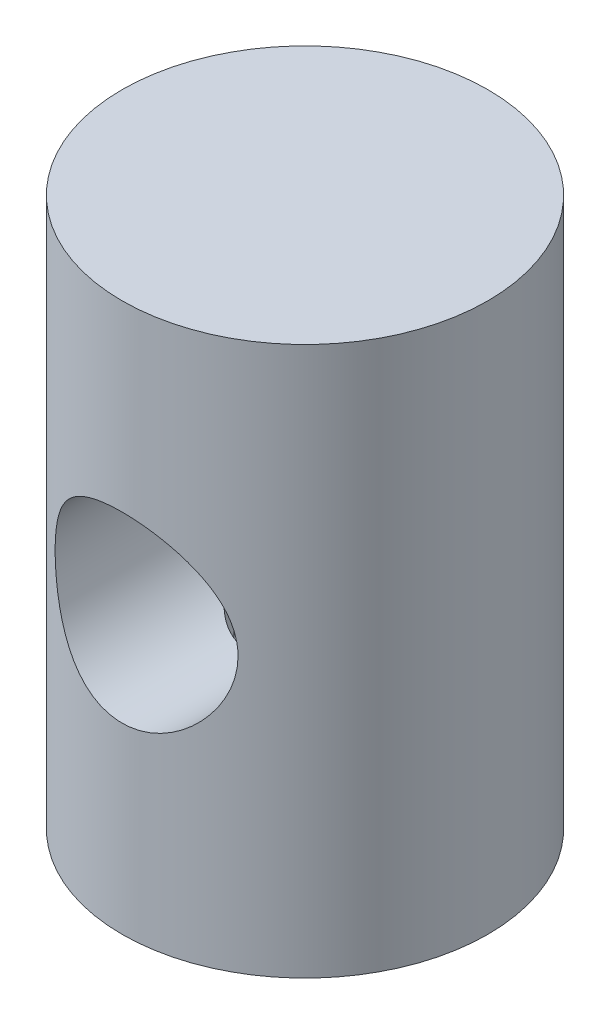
ISO-10303-21;
HEADER;
FILE_DESCRIPTION(('STEP AP214'),'2;1');
FILE_NAME('part.step','',(''),(''),'','','');
FILE_SCHEMA(('AUTOMOTIVE_DESIGN { 1 0 10303 214 1 1 1 1 }'));
ENDSEC;
DATA;
#1=APPLICATION_CONTEXT('core data for automotive mechanical design processes');
#2=APPLICATION_PROTOCOL_DEFINITION('international standard','automotive_design',2000,#1);
#3=PRODUCT_CONTEXT('',#1,'mechanical');
#4=PRODUCT('Part','Part','',(#3));
#5=PRODUCT_RELATED_PRODUCT_CATEGORY('part','',(#4));
#6=PRODUCT_DEFINITION_FORMATION('','',#4);
#7=PRODUCT_DEFINITION_CONTEXT('part definition',#1,'design');
#8=PRODUCT_DEFINITION('design','',#6,#7);
#9=PRODUCT_DEFINITION_SHAPE('','',#8);
#10=(LENGTH_UNIT() NAMED_UNIT(*) SI_UNIT(.MILLI.,.METRE.));
#11=(NAMED_UNIT(*) PLANE_ANGLE_UNIT() SI_UNIT($,.RADIAN.));
#12=(NAMED_UNIT(*) SI_UNIT($,.STERADIAN.) SOLID_ANGLE_UNIT());
#13=UNCERTAINTY_MEASURE_WITH_UNIT(LENGTH_MEASURE(1.E-05),#10,'distance_accuracy_value','');
#14=(GEOMETRIC_REPRESENTATION_CONTEXT(3) GLOBAL_UNCERTAINTY_ASSIGNED_CONTEXT((#13)) GLOBAL_UNIT_ASSIGNED_CONTEXT((#10,
#11,#12)) REPRESENTATION_CONTEXT('',''));
#15=CARTESIAN_POINT('',(0.,0.,0.));
#16=DIRECTION('',(0.,0.,1.));
#17=DIRECTION('',(1.,0.,0.));
#18=AXIS2_PLACEMENT_3D('',#15,#16,#17);
#19=CARTESIAN_POINT('',(0.,-6.,0.));
#20=DIRECTION('',(0.,1.,0.));
#21=DIRECTION('',(1.,0.,0.));
#22=AXIS2_PLACEMENT_3D('',#19,#20,#21);
#23=PLANE('',#22);
#24=CARTESIAN_POINT('',(0.,-6.,0.));
#25=DIRECTION('',(0.,1.,0.));
#26=DIRECTION('',(1.,0.,0.));
#27=AXIS2_PLACEMENT_3D('',#24,#25,#26);
#28=CIRCLE('',#27,4.);
#29=CARTESIAN_POINT('',(4.,-6.,0.));
#30=VERTEX_POINT('',#29);
#31=EDGE_CURVE('E106',#30,#30,#28,.T.);
#32=ORIENTED_EDGE('',*,*,#31,.F.);
#33=EDGE_LOOP('',(#32));
#34=FACE_BOUND('',#33,.T.);
#35=CARTESIAN_POINT('',(0.,-6.,0.));
#36=DIRECTION('',(0.,1.,0.));
#37=DIRECTION('',(1.,0.,0.));
#38=AXIS2_PLACEMENT_3D('',#35,#36,#37);
#39=CIRCLE('',#38,1.5);
#40=CARTESIAN_POINT('',(1.5,-6.,0.));
#41=VERTEX_POINT('',#40);
#42=EDGE_CURVE('E9',#41,#41,#39,.F.);
#43=ORIENTED_EDGE('',*,*,#42,.F.);
#44=EDGE_LOOP('',(#43));
#45=FACE_BOUND('',#44,.T.);
#46=ADVANCED_FACE('F14',(#34,#45),#23,.F.);
#47=CARTESIAN_POINT('',(0.,6.,0.));
#48=DIRECTION('',(0.,-1.,0.));
#49=DIRECTION('',(-1.,0.,0.));
#50=AXIS2_PLACEMENT_3D('',#47,#48,#49);
#51=CYLINDRICAL_SURFACE('',#50,4.);
#52=CARTESIAN_POINT('',(0.,-2.,-4.));
#53=CARTESIAN_POINT('',(0.105143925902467,-1.99999339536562,-3.99999426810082));
#54=CARTESIAN_POINT('',(0.210413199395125,-1.99165985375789,-3.99580982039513));
#55=CARTESIAN_POINT('',(0.417840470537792,-1.95869423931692,-3.97948312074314));
#56=CARTESIAN_POINT('',(0.51999217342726,-1.93403121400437,-3.96732575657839));
#57=CARTESIAN_POINT('',(0.717867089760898,-1.86961238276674,-3.93632558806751));
#58=CARTESIAN_POINT('',(0.813613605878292,-1.82991523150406,-3.91750878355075));
#59=CARTESIAN_POINT('',(0.996945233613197,-1.73685875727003,-3.87491553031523));
#60=CARTESIAN_POINT('',(1.08453098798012,-1.68350051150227,-3.85113947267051));
#61=CARTESIAN_POINT('',(1.25501563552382,-1.56096550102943,-3.79912516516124));
#62=CARTESIAN_POINT('',(1.33731042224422,-1.49102704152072,-3.77070398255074));
#63=CARTESIAN_POINT('',(1.48955888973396,-1.33895704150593,-3.71319940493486));
#64=CARTESIAN_POINT('',(1.55950316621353,-1.25681629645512,-3.68411552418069));
#65=CARTESIAN_POINT('',(1.69050400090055,-1.07503330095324,-3.62597902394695));
#66=CARTESIAN_POINT('',(1.75045067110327,-0.974527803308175,-3.59710373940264));
#67=CARTESIAN_POINT('',(1.85233645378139,-0.763265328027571,-3.54571957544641));
#68=CARTESIAN_POINT('',(1.89428842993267,-0.652515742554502,-3.52320615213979));
#69=CARTESIAN_POINT('',(1.95626488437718,-0.430669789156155,-3.48915734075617));
#70=CARTESIAN_POINT('',(1.97745171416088,-0.319991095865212,-3.47704543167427));
#71=CARTESIAN_POINT('',(2.00085398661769,-0.0960423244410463,-3.46363779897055));
#72=CARTESIAN_POINT('',(2.00308817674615,0.0172250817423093,-3.46233138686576));
#73=CARTESIAN_POINT('',(1.98937457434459,0.228572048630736,-3.47021860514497));
#74=CARTESIAN_POINT('',(1.97556911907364,0.3268480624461,-3.47817527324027));
#75=CARTESIAN_POINT('',(1.93387969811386,0.519443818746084,-3.50152457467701));
#76=CARTESIAN_POINT('',(1.9059912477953,0.613762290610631,-3.51691957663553));
#77=CARTESIAN_POINT('',(1.83641956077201,0.798458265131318,-3.55374952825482));
#78=CARTESIAN_POINT('',(1.79443013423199,0.888692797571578,-3.57531681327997));
#79=CARTESIAN_POINT('',(1.698083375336,1.06126858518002,-3.62206808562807));
#80=CARTESIAN_POINT('',(1.64372048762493,1.14360627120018,-3.64725369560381));
#81=CARTESIAN_POINT('',(1.51613210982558,1.30904250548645,-3.70226315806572));
#82=CARTESIAN_POINT('',(1.44138891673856,1.39091374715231,-3.73227020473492));
#83=CARTESIAN_POINT('',(1.27911115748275,1.5414708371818,-3.79095246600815));
#84=CARTESIAN_POINT('',(1.19157051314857,1.61015038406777,-3.81962703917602));
#85=CARTESIAN_POINT('',(1.0010330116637,1.73537132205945,-3.87403974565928));
#86=CARTESIAN_POINT('',(0.897507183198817,1.79120094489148,-3.89957968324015));
#87=CARTESIAN_POINT('',(0.680932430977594,1.88419405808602,-3.94315762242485));
#88=CARTESIAN_POINT('',(0.567891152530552,1.92137237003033,-3.96120157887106));
#89=CARTESIAN_POINT('',(0.345532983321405,1.97295080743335,-3.98648667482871));
#90=CARTESIAN_POINT('',(0.236683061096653,1.98898247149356,-3.9944987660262));
#91=CARTESIAN_POINT('',(0.0175591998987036,2.00292946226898,-4.00146026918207));
#92=CARTESIAN_POINT('',(-0.0927140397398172,2.00085337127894,-4.00041397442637));
#93=CARTESIAN_POINT('',(-0.302465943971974,1.97958662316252,-3.9898238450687));
#94=CARTESIAN_POINT('',(-0.40211881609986,1.96173493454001,-3.98094491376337));
#95=CARTESIAN_POINT('',(-0.596813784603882,1.91152385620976,-3.95644342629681));
#96=CARTESIAN_POINT('',(-0.691855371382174,1.87916286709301,-3.94082012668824));
#97=CARTESIAN_POINT('',(-0.877777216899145,1.80000306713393,-3.90368502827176));
#98=CARTESIAN_POINT('',(-0.968460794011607,1.75281789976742,-3.88201763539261));
#99=CARTESIAN_POINT('',(-1.14092272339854,1.64578492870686,-3.83487948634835));
#100=CARTESIAN_POINT('',(-1.22269725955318,1.58593173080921,-3.80940711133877));
#101=CARTESIAN_POINT('',(-1.38353537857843,1.44847914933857,-3.75416442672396));
#102=CARTESIAN_POINT('',(-1.46154415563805,1.36971426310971,-3.72421769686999));
#103=CARTESIAN_POINT('',(-1.60371264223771,1.20014969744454,-3.6652478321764));
#104=CARTESIAN_POINT('',(-1.66786277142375,1.10934176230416,-3.63622534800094));
#105=CARTESIAN_POINT('',(-1.78341582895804,0.912712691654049,-3.58102384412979));
#106=CARTESIAN_POINT('',(-1.8340509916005,0.806377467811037,-3.55505059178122));
#107=CARTESIAN_POINT('',(-1.91616565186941,0.584979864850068,-3.51148144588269));
#108=CARTESIAN_POINT('',(-1.94766983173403,0.46992894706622,-3.493874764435));
#109=CARTESIAN_POINT('',(-1.98772337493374,0.246179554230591,-3.47123002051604));
#110=CARTESIAN_POINT('',(-1.9981859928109,0.137931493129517,-3.4651476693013));
#111=CARTESIAN_POINT('',(-2.00137830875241,-0.0788941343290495,-3.46330709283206));
#112=CARTESIAN_POINT('',(-1.99411569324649,-0.187471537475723,-3.4675443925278));
#113=CARTESIAN_POINT('',(-1.96385225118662,-0.390967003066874,-3.48475724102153));
#114=CARTESIAN_POINT('',(-1.94241662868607,-0.486200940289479,-3.49686188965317));
#115=CARTESIAN_POINT('',(-1.88635071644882,-0.671616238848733,-3.52742032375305));
#116=CARTESIAN_POINT('',(-1.85171618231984,-0.761795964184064,-3.54587615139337));
#117=CARTESIAN_POINT('',(-1.76763149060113,-0.941249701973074,-3.58857060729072));
#118=CARTESIAN_POINT('',(-1.7173422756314,-1.03005580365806,-3.61311444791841));
#119=CARTESIAN_POINT('',(-1.60430194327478,-1.19854907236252,-3.66470663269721));
#120=CARTESIAN_POINT('',(-1.54154434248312,-1.27823146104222,-3.69175627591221));
#121=CARTESIAN_POINT('',(-1.39640665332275,-1.43628396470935,-3.74924646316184));
#122=CARTESIAN_POINT('',(-1.31256884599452,-1.51331820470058,-3.77969966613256));
#123=CARTESIAN_POINT('',(-1.13230961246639,-1.65252596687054,-3.83755504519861));
#124=CARTESIAN_POINT('',(-1.03588144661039,-1.71469147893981,-3.8649555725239));
#125=CARTESIAN_POINT('',(-0.831863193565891,-1.82247272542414,-3.91396019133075));
#126=CARTESIAN_POINT('',(-0.724199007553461,-1.86796833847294,-3.93552192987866));
#127=CARTESIAN_POINT('',(-0.501484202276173,-1.93961633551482,-3.97002682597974));
#128=CARTESIAN_POINT('',(-0.3864555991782,-1.96582369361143,-3.98299446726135));
#129=CARTESIAN_POINT('',(-0.22520389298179,-1.98779482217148,-3.99390923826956));
#130=CARTESIAN_POINT('',(-0.18032375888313,-1.99236528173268,-3.99618730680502));
#131=CARTESIAN_POINT('',(-0.0903034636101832,-1.99846933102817,-3.99923393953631));
#132=CARTESIAN_POINT('',(-0.0451632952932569,-2.00000283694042,-4.00000246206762));
#133=CARTESIAN_POINT('',(0.,-2.,-4.));
#134=B_SPLINE_CURVE_WITH_KNOTS('',3,(#52,#53,#54,#55,#56,#57,#58,#59,#60,#61,#62,#63,#64,#65,
#66,#67,#68,#69,#70,#71,#72,#73,#74,#75,#76,#77,#78,#79,#80,#81,#82,#83,#84,#85,#86,#87,#88,#89,
#90,#91,#92,#93,#94,#95,#96,#97,#98,#99,#100,#101,#102,#103,#104,#105,#106,#107,#108,#109,#110,
#111,#112,#113,#114,#115,#116,#117,#118,#119,#120,#121,#122,#123,#124,#125,#126,#127,#128,#129,
#130,#131,#132,#133),.UNSPECIFIED.,.T.,.F.,(4,2,2,2,2,2,2,2,2,2,2,2,2,2,2,2,2,2,2,2,2,2,2,2,2,2,
2,2,2,2,2,2,2,2,2,2,2,2,2,2,4),(0.,0.315248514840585,0.631096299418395,0.945724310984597,
1.26032752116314,1.59396351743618,1.92785247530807,2.28763452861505,2.64715895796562,
2.98516024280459,3.32282714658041,3.62011424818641,3.91749607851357,4.22180480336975,
4.52625042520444,4.86929882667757,5.21251069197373,5.57166044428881,5.93052433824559,
6.25966580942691,6.58865129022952,6.89213813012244,7.19565843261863,7.50785712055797,
7.82018901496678,8.16319221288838,8.50643177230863,8.86629364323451,9.22569023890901,
9.55058615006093,9.87534119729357,10.1691586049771,10.463070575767,10.7767291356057,
11.0905512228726,11.4425048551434,11.7946476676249,12.1492802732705,12.502898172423,
12.6383056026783,12.7737167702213),.UNSPECIFIED.);
#135=CARTESIAN_POINT('',(0.,-2.,-4.));
#136=VERTEX_POINT('',#135);
#137=EDGE_CURVE('E213',#136,#136,#134,.T.);
#138=ORIENTED_EDGE('',*,*,#137,.T.);
#139=EDGE_LOOP('',(#138));
#140=FACE_BOUND('',#139,.T.);
#141=CARTESIAN_POINT('',(2.,0.,3.46410161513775));
#142=CARTESIAN_POINT('',(1.99999158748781,-0.104213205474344,3.46411185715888));
#143=CARTESIAN_POINT('',(1.99179963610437,-0.208562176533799,3.46887633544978));
#144=CARTESIAN_POINT('',(1.95944672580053,-0.414055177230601,3.48724701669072));
#145=CARTESIAN_POINT('',(1.93525221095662,-0.515192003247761,3.50087179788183));
#146=CARTESIAN_POINT('',(1.8721998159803,-0.710903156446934,3.53498701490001));
#147=CARTESIAN_POINT('',(1.83341988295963,-0.80550925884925,3.55544089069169));
#148=CARTESIAN_POINT('',(1.74253507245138,-0.986848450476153,3.60085327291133));
#149=CARTESIAN_POINT('',(1.69042947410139,-1.07358111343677,3.62581202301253));
#150=CARTESIAN_POINT('',(1.569333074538,-1.24461144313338,3.67993738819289));
#151=CARTESIAN_POINT('',(1.49930407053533,-1.32811826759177,3.70928127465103));
#152=CARTESIAN_POINT('',(1.34650761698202,-1.4828167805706,3.76743965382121));
#153=CARTESIAN_POINT('',(1.26373385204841,-1.55400232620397,3.79625387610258));
#154=CARTESIAN_POINT('',(1.08097912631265,-1.6867343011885,3.85242953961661));
#155=CARTESIAN_POINT('',(0.980214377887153,-1.74730753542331,3.87956212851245));
#156=CARTESIAN_POINT('',(0.768314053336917,-1.85028170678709,3.92701512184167));
#157=CARTESIAN_POINT('',(0.657185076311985,-1.8926941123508,3.94733982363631));
#158=CARTESIAN_POINT('',(0.436089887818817,-1.95500932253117,3.97760922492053));
#159=CARTESIAN_POINT('',(0.326603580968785,-1.9762990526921,3.9881896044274));
#160=CARTESIAN_POINT('',(0.10514125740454,-2.00033223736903,4.00015167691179));
#161=CARTESIAN_POINT('',(-0.0068332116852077,-2.00308691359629,4.00153893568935));
#162=CARTESIAN_POINT('',(-0.219665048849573,-1.99050665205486,3.99525963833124));
#163=CARTESIAN_POINT('',(-0.320642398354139,-1.97672396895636,3.98836991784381));
#164=CARTESIAN_POINT('',(-0.518627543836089,-1.93423831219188,3.96748490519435));
#165=CARTESIAN_POINT('',(-0.615635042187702,-1.90553422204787,3.95348908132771));
#166=CARTESIAN_POINT('',(-0.80461878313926,-1.83383486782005,3.91943166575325));
#167=CARTESIAN_POINT('',(-0.896506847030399,-1.79064737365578,3.89928883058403));
#168=CARTESIAN_POINT('',(-1.07195360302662,-1.6914731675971,3.8547529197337));
#169=CARTESIAN_POINT('',(-1.15550929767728,-1.63548187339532,3.83035832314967));
#170=CARTESIAN_POINT('',(-1.3203473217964,-1.50620929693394,3.7768878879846));
#171=CARTESIAN_POINT('',(-1.40066815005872,-1.43179394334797,3.7475875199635));
#172=CARTESIAN_POINT('',(-1.54820874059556,-1.27082055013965,3.68908681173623));
#173=CARTESIAN_POINT('',(-1.61541842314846,-1.18425325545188,3.65988656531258));
#174=CARTESIAN_POINT('',(-1.73901066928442,-0.994703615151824,3.60288312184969));
#175=CARTESIAN_POINT('',(-1.7944346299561,-0.891027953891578,3.57528639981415));
#176=CARTESIAN_POINT('',(-1.88663822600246,-0.674124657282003,3.52750900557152));
#177=CARTESIAN_POINT('',(-1.92343731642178,-0.560907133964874,3.50732060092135));
#178=CARTESIAN_POINT('',(-1.97436042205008,-0.33757097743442,3.47889271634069));
#179=CARTESIAN_POINT('',(-1.99005024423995,-0.227917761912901,3.46983311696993));
#180=CARTESIAN_POINT('',(-2.00303389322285,-0.00719731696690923,3.46235838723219));
#181=CARTESIAN_POINT('',(-2.00034071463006,0.103868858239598,3.46393573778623));
#182=CARTESIAN_POINT('',(-1.97807208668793,0.311307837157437,3.4766867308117));
#183=CARTESIAN_POINT('',(-1.96037563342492,0.407958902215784,3.48679175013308));
#184=CARTESIAN_POINT('',(-1.91139256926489,0.596735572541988,3.51388043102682));
#185=CARTESIAN_POINT('',(-1.88010155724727,0.688859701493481,3.53086632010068));
#186=CARTESIAN_POINT('',(-1.80329517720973,0.870822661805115,3.57072444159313));
#187=CARTESIAN_POINT('',(-1.7571881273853,0.960358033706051,3.59383286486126));
#188=CARTESIAN_POINT('',(-1.65257412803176,1.13093854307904,3.643122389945));
#189=CARTESIAN_POINT('',(-1.59406080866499,1.21197928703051,3.66930506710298));
#190=CARTESIAN_POINT('',(-1.45767433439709,1.37395753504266,3.72575996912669));
#191=CARTESIAN_POINT('',(-1.37829054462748,1.45359430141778,3.75613166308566));
#192=CARTESIAN_POINT('',(-1.20680899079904,1.59882447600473,3.81468469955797));
#193=CARTESIAN_POINT('',(-1.11470694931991,1.66441314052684,3.84286530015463));
#194=CARTESIAN_POINT('',(-0.917070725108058,1.78114745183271,3.89482723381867));
#195=CARTESIAN_POINT('',(-0.811246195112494,1.83186623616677,3.91847283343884));
#196=CARTESIAN_POINT('',(-0.591044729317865,1.91427580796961,3.95766709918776));
#197=CARTESIAN_POINT('',(-0.476675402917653,1.9459833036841,3.97322287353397));
#198=CARTESIAN_POINT('',(-0.253959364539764,1.98673712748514,3.99335016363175));
#199=CARTESIAN_POINT('',(-0.1460228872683,1.99759574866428,3.9987985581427));
#200=CARTESIAN_POINT('',(0.0702519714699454,2.00168653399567,4.00084260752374));
#201=CARTESIAN_POINT('',(0.178590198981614,1.99492486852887,3.99744136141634));
#202=CARTESIAN_POINT('',(0.385075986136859,1.96516717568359,3.98267937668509));
#203=CARTESIAN_POINT('',(0.483424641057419,1.94327026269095,3.97185789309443));
#204=CARTESIAN_POINT('',(0.674891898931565,1.88534604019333,3.94384187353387));
#205=CARTESIAN_POINT('',(0.768009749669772,1.84931670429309,3.92664642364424));
#206=CARTESIAN_POINT('',(0.950846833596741,1.7625457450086,3.88651861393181));
#207=CARTESIAN_POINT('',(1.0402503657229,1.71124078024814,3.86337234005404));
#208=CARTESIAN_POINT('',(1.20954920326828,1.59608471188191,3.81376266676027));
#209=CARTESIAN_POINT('',(1.28944011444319,1.53222784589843,3.78729774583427));
#210=CARTESIAN_POINT('',(1.44582833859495,1.38640336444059,3.73057218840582));
#211=CARTESIAN_POINT('',(1.52119665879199,1.30326581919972,3.70019591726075));
#212=CARTESIAN_POINT('',(1.65732528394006,1.12510777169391,3.64126158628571));
#213=CARTESIAN_POINT('',(1.71807266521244,1.03007686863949,3.61270515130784));
#214=CARTESIAN_POINT('',(1.82486714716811,0.826691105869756,3.55999186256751));
#215=CARTESIAN_POINT('',(1.87038902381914,0.718010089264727,3.53600256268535));
#216=CARTESIAN_POINT('',(1.92395929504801,0.549421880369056,3.5069621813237));
#217=CARTESIAN_POINT('',(1.93935666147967,0.492352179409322,3.49844389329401));
#218=CARTESIAN_POINT('',(1.96508069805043,0.376767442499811,3.48406059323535));
#219=CARTESIAN_POINT('',(1.97541091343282,0.318253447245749,3.4781937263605));
#220=CARTESIAN_POINT('',(1.9887293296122,0.21639921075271,3.47059023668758));
#221=CARTESIAN_POINT('',(1.99295091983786,0.173266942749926,3.46816389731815));
#222=CARTESIAN_POINT('',(1.99858810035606,0.0867643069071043,3.46491740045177));
#223=CARTESIAN_POINT('',(2.00000350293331,0.0433939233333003,3.46409735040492));
#224=CARTESIAN_POINT('',(2.,0.,3.46410161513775));
#225=B_SPLINE_CURVE_WITH_KNOTS('',3,(#141,#142,#143,#144,#145,#146,#147,#148,#149,#150,#151,
#152,#153,#154,#155,#156,#157,#158,#159,#160,#161,#162,#163,#164,#165,#166,#167,#168,#169,#170,
#171,#172,#173,#174,#175,#176,#177,#178,#179,#180,#181,#182,#183,#184,#185,#186,#187,#188,#189,
#190,#191,#192,#193,#194,#195,#196,#197,#198,#199,#200,#201,#202,#203,#204,#205,#206,#207,#208,
#209,#210,#211,#212,#213,#214,#215,#216,#217,#218,#219,#220,#221,#222,#223,#224),.UNSPECIFIED.,
.T.,.F.,(4,2,2,2,2,2,2,2,2,2,2,2,2,2,2,2,2,2,2,2,2,2,2,2,2,2,2,2,2,2,2,2,2,2,2,2,2,2,2,2,2,4),
(0.,0.312464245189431,0.62558578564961,0.937057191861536,1.24854545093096,1.58572462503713,
1.92307142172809,2.28315784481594,2.64301653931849,2.97726969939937,3.31132047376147,
3.61632194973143,3.92134625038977,4.2305906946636,4.5399459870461,4.87854382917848,
5.21740096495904,5.57777683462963,5.93777548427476,6.2692458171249,6.60048186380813,
6.89548366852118,7.19058104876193,7.49934592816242,7.80826972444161,8.15613487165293,
8.50411729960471,8.86128362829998,9.2181355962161,9.5422454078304,9.8662417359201,
10.1688884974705,10.4715786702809,10.7872150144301,11.102996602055,11.450204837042,
11.7977188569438,12.1562149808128,12.3351395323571,12.5139387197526,12.6440387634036,
12.7741475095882),.UNSPECIFIED.);
#226=CARTESIAN_POINT('',(2.,0.,3.46410161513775));
#227=VERTEX_POINT('',#226);
#228=EDGE_CURVE('E207',#227,#227,#225,.T.);
#229=ORIENTED_EDGE('',*,*,#228,.T.);
#230=EDGE_LOOP('',(#229));
#231=FACE_BOUND('',#230,.T.);
#232=CARTESIAN_POINT('',(0.,6.,0.));
#233=DIRECTION('',(0.,1.,0.));
#234=DIRECTION('',(1.,0.,0.));
#235=AXIS2_PLACEMENT_3D('',#232,#233,#234);
#236=CIRCLE('',#235,4.);
#237=CARTESIAN_POINT('',(4.,6.,0.));
#238=VERTEX_POINT('',#237);
#239=EDGE_CURVE('E109',#238,#238,#236,.T.);
#240=ORIENTED_EDGE('',*,*,#239,.F.);
#241=EDGE_LOOP('',(#240));
#242=FACE_BOUND('',#241,.T.);
#243=ORIENTED_EDGE('',*,*,#31,.T.);
#244=EDGE_LOOP('',(#243));
#245=FACE_BOUND('',#244,.T.);
#246=ADVANCED_FACE('F16',(#140,#231,#242,#245),#51,.T.);
#247=CARTESIAN_POINT('',(0.,6.,0.));
#248=DIRECTION('',(0.,1.,0.));
#249=DIRECTION('',(1.,0.,0.));
#250=AXIS2_PLACEMENT_3D('',#247,#248,#249);
#251=PLANE('',#250);
#252=ORIENTED_EDGE('',*,*,#239,.T.);
#253=EDGE_LOOP('',(#252));
#254=FACE_BOUND('',#253,.T.);
#255=ADVANCED_FACE('F138',(#254),#251,.T.);
#256=CARTESIAN_POINT('',(0.,-4.,0.));
#257=DIRECTION('',(0.,1.,0.));
#258=DIRECTION('',(0.5,0.,-0.866025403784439));
#259=AXIS2_PLACEMENT_3D('',#256,#257,#258);
#260=CYLINDRICAL_SURFACE('',#259,1.5);
#261=CARTESIAN_POINT('',(0.,-7.,0.));
#262=DIRECTION('',(0.,1.,0.));
#263=DIRECTION('',(0.5,0.,-0.866025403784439));
#264=AXIS2_PLACEMENT_3D('',#261,#262,#263);
#265=CIRCLE('',#264,1.5);
#266=CARTESIAN_POINT('',(0.749999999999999,-7.,-1.29903810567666));
#267=VERTEX_POINT('',#266);
#268=EDGE_CURVE('E102',#267,#267,#265,.T.);
#269=ORIENTED_EDGE('',*,*,#268,.T.);
#270=EDGE_LOOP('',(#269));
#271=FACE_BOUND('',#270,.T.);
#272=ORIENTED_EDGE('',*,*,#42,.T.);
#273=EDGE_LOOP('',(#272));
#274=FACE_BOUND('',#273,.T.);
#275=ADVANCED_FACE('F143',(#271,#274),#260,.T.);
#276=CARTESIAN_POINT('',(-1.29903810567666,-5.8,0.75));
#277=DIRECTION('',(0.,-1.,0.));
#278=DIRECTION('',(-0.5,0.,0.866025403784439));
#279=AXIS2_PLACEMENT_3D('',#276,#277,#278);
#280=PLANE('',#279);
#281=DIRECTION('',(-1.,0.,0.));
#282=VECTOR('',#281,1.);
#283=CARTESIAN_POINT('',(0.433012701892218,-5.8,0.75));
#284=LINE('',#283,#282);
#285=CARTESIAN_POINT('',(0.433012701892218,-5.8,0.75));
#286=VERTEX_POINT('',#285);
#287=CARTESIAN_POINT('',(-0.433012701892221,-5.8,0.75));
#288=VERTEX_POINT('',#287);
#289=EDGE_CURVE('E242',#286,#288,#284,.T.);
#290=ORIENTED_EDGE('',*,*,#289,.T.);
#291=DIRECTION('',(-0.5,0.,-0.866025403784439));
#292=VECTOR('',#291,1.);
#293=CARTESIAN_POINT('',(-0.433012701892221,-5.8,0.75));
#294=LINE('',#293,#292);
#295=CARTESIAN_POINT('',(-0.86602540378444,-5.8,0.));
#296=VERTEX_POINT('',#295);
#297=EDGE_CURVE('E86',#288,#296,#294,.T.);
#298=ORIENTED_EDGE('',*,*,#297,.T.);
#299=DIRECTION('',(0.5,0.,-0.866025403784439));
#300=VECTOR('',#299,1.);
#301=CARTESIAN_POINT('',(-0.86602540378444,-5.8,0.));
#302=LINE('',#301,#300);
#303=CARTESIAN_POINT('',(-0.43301270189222,-5.8,-0.75));
#304=VERTEX_POINT('',#303);
#305=EDGE_CURVE('E238',#296,#304,#302,.T.);
#306=ORIENTED_EDGE('',*,*,#305,.T.);
#307=DIRECTION('',(1.,0.,0.));
#308=VECTOR('',#307,1.);
#309=CARTESIAN_POINT('',(-0.43301270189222,-5.8,-0.75));
#310=LINE('',#309,#308);
#311=CARTESIAN_POINT('',(0.433012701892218,-5.8,-0.75));
#312=VERTEX_POINT('',#311);
#313=EDGE_CURVE('E235',#304,#312,#310,.T.);
#314=ORIENTED_EDGE('',*,*,#313,.T.);
#315=DIRECTION('',(0.5,0.,0.866025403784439));
#316=VECTOR('',#315,1.);
#317=CARTESIAN_POINT('',(0.433012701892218,-5.8,-0.75));
#318=LINE('',#317,#316);
#319=CARTESIAN_POINT('',(0.866025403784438,-5.8,0.));
#320=VERTEX_POINT('',#319);
#321=EDGE_CURVE('E232',#312,#320,#318,.T.);
#322=ORIENTED_EDGE('',*,*,#321,.T.);
#323=DIRECTION('',(-0.5,0.,0.866025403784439));
#324=VECTOR('',#323,1.);
#325=CARTESIAN_POINT('',(0.866025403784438,-5.8,0.));
#326=LINE('',#325,#324);
#327=EDGE_CURVE('E88',#320,#286,#326,.T.);
#328=ORIENTED_EDGE('',*,*,#327,.T.);
#329=EDGE_LOOP('',(#290,#298,#306,#314,#322,#328));
#330=FACE_BOUND('',#329,.T.);
#331=ADVANCED_FACE('F149',(#330),#280,.T.);
#332=CARTESIAN_POINT('',(-0.86602540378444,-5.8,0.));
#333=DIRECTION('',(-0.866025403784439,0.,-0.5));
#334=DIRECTION('',(0.5,0.,-0.866025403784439));
#335=AXIS2_PLACEMENT_3D('',#332,#333,#334);
#336=PLANE('',#335);
#337=DIRECTION('',(0.5,0.,-0.866025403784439));
#338=VECTOR('',#337,1.);
#339=CARTESIAN_POINT('',(-0.86602540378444,-7.,0.));
#340=LINE('',#339,#338);
#341=CARTESIAN_POINT('',(-0.86602540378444,-7.,0.));
#342=VERTEX_POINT('',#341);
#343=CARTESIAN_POINT('',(-0.43301270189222,-7.,-0.75));
#344=VERTEX_POINT('',#343);
#345=EDGE_CURVE('E93',#342,#344,#340,.T.);
#346=ORIENTED_EDGE('',*,*,#345,.T.);
#347=DIRECTION('',(0.,-1.,0.));
#348=VECTOR('',#347,1.);
#349=CARTESIAN_POINT('',(-0.43301270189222,-5.8,-0.75));
#350=LINE('',#349,#348);
#351=EDGE_CURVE('E38',#304,#344,#350,.T.);
#352=ORIENTED_EDGE('',*,*,#351,.F.);
#353=ORIENTED_EDGE('',*,*,#305,.F.);
#354=DIRECTION('',(0.,-1.,0.));
#355=VECTOR('',#354,1.);
#356=CARTESIAN_POINT('',(-0.86602540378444,-5.8,0.));
#357=LINE('',#356,#355);
#358=EDGE_CURVE('E30',#296,#342,#357,.T.);
#359=ORIENTED_EDGE('',*,*,#358,.T.);
#360=EDGE_LOOP('',(#346,#352,#353,#359));
#361=FACE_BOUND('',#360,.T.);
#362=ADVANCED_FACE('F159',(#361),#336,.F.);
#363=CARTESIAN_POINT('',(-0.43301270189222,-5.8,-0.75));
#364=DIRECTION('',(0.,0.,-1.));
#365=DIRECTION('',(1.,0.,0.));
#366=AXIS2_PLACEMENT_3D('',#363,#364,#365);
#367=PLANE('',#366);
#368=DIRECTION('',(1.,0.,0.));
#369=VECTOR('',#368,1.);
#370=CARTESIAN_POINT('',(-0.43301270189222,-7.,-0.75));
#371=LINE('',#370,#369);
#372=CARTESIAN_POINT('',(0.433012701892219,-7.,-0.75));
#373=VERTEX_POINT('',#372);
#374=EDGE_CURVE('E95',#344,#373,#371,.T.);
#375=ORIENTED_EDGE('',*,*,#374,.T.);
#376=DIRECTION('',(0.,-1.,0.));
#377=VECTOR('',#376,1.);
#378=CARTESIAN_POINT('',(0.433012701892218,-5.8,-0.75));
#379=LINE('',#378,#377);
#380=EDGE_CURVE('E225',#312,#373,#379,.T.);
#381=ORIENTED_EDGE('',*,*,#380,.F.);
#382=ORIENTED_EDGE('',*,*,#313,.F.);
#383=ORIENTED_EDGE('',*,*,#351,.T.);
#384=EDGE_LOOP('',(#375,#381,#382,#383));
#385=FACE_BOUND('',#384,.T.);
#386=ADVANCED_FACE('F176',(#385),#367,.F.);
#387=CARTESIAN_POINT('',(0.433012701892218,-5.8,-0.75));
#388=DIRECTION('',(0.866025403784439,0.,-0.5));
#389=DIRECTION('',(0.5,0.,0.866025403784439));
#390=AXIS2_PLACEMENT_3D('',#387,#388,#389);
#391=PLANE('',#390);
#392=DIRECTION('',(0.5,0.,0.866025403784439));
#393=VECTOR('',#392,1.);
#394=CARTESIAN_POINT('',(0.433012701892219,-7.,-0.75));
#395=LINE('',#394,#393);
#396=CARTESIAN_POINT('',(0.866025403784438,-7.,0.));
#397=VERTEX_POINT('',#396);
#398=EDGE_CURVE('E246',#373,#397,#395,.T.);
#399=ORIENTED_EDGE('',*,*,#398,.T.);
#400=DIRECTION('',(0.,-1.,0.));
#401=VECTOR('',#400,1.);
#402=CARTESIAN_POINT('',(0.866025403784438,-5.8,0.));
#403=LINE('',#402,#401);
#404=EDGE_CURVE('E227',#320,#397,#403,.T.);
#405=ORIENTED_EDGE('',*,*,#404,.F.);
#406=ORIENTED_EDGE('',*,*,#321,.F.);
#407=ORIENTED_EDGE('',*,*,#380,.T.);
#408=EDGE_LOOP('',(#399,#405,#406,#407));
#409=FACE_BOUND('',#408,.T.);
#410=ADVANCED_FACE('F179',(#409),#391,.F.);
#411=CARTESIAN_POINT('',(0.866025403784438,-5.8,0.));
#412=DIRECTION('',(0.866025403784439,0.,0.5));
#413=DIRECTION('',(-0.5,0.,0.866025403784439));
#414=AXIS2_PLACEMENT_3D('',#411,#412,#413);
#415=PLANE('',#414);
#416=DIRECTION('',(-0.5,0.,0.866025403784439));
#417=VECTOR('',#416,1.);
#418=CARTESIAN_POINT('',(0.866025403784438,-7.,0.));
#419=LINE('',#418,#417);
#420=CARTESIAN_POINT('',(0.433012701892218,-7.,0.75));
#421=VERTEX_POINT('',#420);
#422=EDGE_CURVE('E244',#397,#421,#419,.T.);
#423=ORIENTED_EDGE('',*,*,#422,.T.);
#424=DIRECTION('',(0.,-1.,0.));
#425=VECTOR('',#424,1.);
#426=CARTESIAN_POINT('',(0.433012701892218,-5.8,0.75));
#427=LINE('',#426,#425);
#428=EDGE_CURVE('E74',#286,#421,#427,.T.);
#429=ORIENTED_EDGE('',*,*,#428,.F.);
#430=ORIENTED_EDGE('',*,*,#327,.F.);
#431=ORIENTED_EDGE('',*,*,#404,.T.);
#432=EDGE_LOOP('',(#423,#429,#430,#431));
#433=FACE_BOUND('',#432,.T.);
#434=ADVANCED_FACE('F171',(#433),#415,.F.);
#435=CARTESIAN_POINT('',(0.433012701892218,-5.8,0.75));
#436=DIRECTION('',(0.,0.,1.));
#437=DIRECTION('',(-1.,0.,0.));
#438=AXIS2_PLACEMENT_3D('',#435,#436,#437);
#439=PLANE('',#438);
#440=DIRECTION('',(-1.,0.,0.));
#441=VECTOR('',#440,1.);
#442=CARTESIAN_POINT('',(0.433012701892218,-7.,0.75));
#443=LINE('',#442,#441);
#444=CARTESIAN_POINT('',(-0.43301270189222,-7.,0.75));
#445=VERTEX_POINT('',#444);
#446=EDGE_CURVE('E68',#421,#445,#443,.T.);
#447=ORIENTED_EDGE('',*,*,#446,.T.);
#448=DIRECTION('',(0.,-1.,0.));
#449=VECTOR('',#448,1.);
#450=CARTESIAN_POINT('',(-0.433012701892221,-5.8,0.75));
#451=LINE('',#450,#449);
#452=EDGE_CURVE('E72',#288,#445,#451,.T.);
#453=ORIENTED_EDGE('',*,*,#452,.F.);
#454=ORIENTED_EDGE('',*,*,#289,.F.);
#455=ORIENTED_EDGE('',*,*,#428,.T.);
#456=EDGE_LOOP('',(#447,#453,#454,#455));
#457=FACE_BOUND('',#456,.T.);
#458=ADVANCED_FACE('F70',(#457),#439,.F.);
#459=CARTESIAN_POINT('',(-0.433012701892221,-5.8,0.75));
#460=DIRECTION('',(-0.866025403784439,0.,0.5));
#461=DIRECTION('',(-0.5,0.,-0.866025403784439));
#462=AXIS2_PLACEMENT_3D('',#459,#460,#461);
#463=PLANE('',#462);
#464=DIRECTION('',(-0.5,0.,-0.866025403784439));
#465=VECTOR('',#464,1.);
#466=CARTESIAN_POINT('',(-0.43301270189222,-7.,0.75));
#467=LINE('',#466,#465);
#468=EDGE_CURVE('E80',#445,#342,#467,.T.);
#469=ORIENTED_EDGE('',*,*,#468,.T.);
#470=ORIENTED_EDGE('',*,*,#358,.F.);
#471=ORIENTED_EDGE('',*,*,#297,.F.);
#472=ORIENTED_EDGE('',*,*,#452,.T.);
#473=EDGE_LOOP('',(#469,#470,#471,#472));
#474=FACE_BOUND('',#473,.T.);
#475=ADVANCED_FACE('F83',(#474),#463,.F.);
#476=CARTESIAN_POINT('',(0.,-7.,0.));
#477=DIRECTION('',(0.,1.,0.));
#478=DIRECTION('',(0.5,0.,-0.866025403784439));
#479=AXIS2_PLACEMENT_3D('',#476,#477,#478);
#480=PLANE('',#479);
#481=ORIENTED_EDGE('',*,*,#468,.F.);
#482=ORIENTED_EDGE('',*,*,#446,.F.);
#483=ORIENTED_EDGE('',*,*,#422,.F.);
#484=ORIENTED_EDGE('',*,*,#398,.F.);
#485=ORIENTED_EDGE('',*,*,#374,.F.);
#486=ORIENTED_EDGE('',*,*,#345,.F.);
#487=EDGE_LOOP('',(#481,#482,#483,#484,#485,#486));
#488=FACE_BOUND('',#487,.T.);
#489=ORIENTED_EDGE('',*,*,#268,.F.);
#490=EDGE_LOOP('',(#489));
#491=FACE_BOUND('',#490,.T.);
#492=ADVANCED_FACE('F90',(#488,#491),#480,.F.);
#493=CARTESIAN_POINT('',(0.,0.,-4.));
#494=DIRECTION('',(0.,0.,1.));
#495=DIRECTION('',(1.,0.,0.));
#496=AXIS2_PLACEMENT_3D('',#493,#494,#495);
#497=CYLINDRICAL_SURFACE('',#496,2.);
#498=ORIENTED_EDGE('',*,*,#137,.F.);
#499=EDGE_LOOP('',(#498));
#500=FACE_BOUND('',#499,.T.);
#501=ORIENTED_EDGE('',*,*,#228,.F.);
#502=EDGE_LOOP('',(#501));
#503=FACE_BOUND('',#502,.T.);
#504=CARTESIAN_POINT('',(-1.25,-1.5612494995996,0.));
#505=CARTESIAN_POINT('',(-1.24999462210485,-1.56125800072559,0.0621202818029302));
#506=CARTESIAN_POINT('',(-1.24532693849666,-1.56502642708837,0.124337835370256));
#507=CARTESIAN_POINT('',(-1.22698950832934,-1.57943717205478,0.246676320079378));
#508=CARTESIAN_POINT('',(-1.21329530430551,-1.59009816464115,0.306791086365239));
#509=CARTESIAN_POINT('',(-1.17788073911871,-1.61650085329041,0.422782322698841));
#510=CARTESIAN_POINT('',(-1.15622993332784,-1.63219837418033,0.478690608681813));
#511=CARTESIAN_POINT('',(-1.10571945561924,-1.66682950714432,0.586008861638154));
#512=CARTESIAN_POINT('',(-1.07685958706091,-1.68576320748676,0.637418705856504));
#513=CARTESIAN_POINT('',(-1.00823937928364,-1.72779611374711,0.741865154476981));
#514=CARTESIAN_POINT('',(-0.967536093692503,-1.75111338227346,0.794194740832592));
#515=CARTESIAN_POINT('',(-0.878308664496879,-1.79752820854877,0.891882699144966));
#516=CARTESIAN_POINT('',(-0.829777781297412,-1.82062555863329,0.937234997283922));
#517=CARTESIAN_POINT('',(-0.71918666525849,-1.86729453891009,1.02510358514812));
#518=CARTESIAN_POINT('',(-0.656200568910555,-1.8905872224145,1.06661766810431));
#519=CARTESIAN_POINT('',(-0.522404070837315,-1.9318323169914,1.13812520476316));
#520=CARTESIAN_POINT('',(-0.451601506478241,-1.94979001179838,1.16813006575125));
#521=CARTESIAN_POINT('',(-0.311776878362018,-1.97669841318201,1.21248231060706));
#522=CARTESIAN_POINT('',(-0.243305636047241,-1.98637922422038,1.22811141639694));
#523=CARTESIAN_POINT('',(-0.104105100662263,-1.99850544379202,1.2476320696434));
#524=CARTESIAN_POINT('',(-0.0333782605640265,-2.00095845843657,1.25153595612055));
#525=CARTESIAN_POINT('',(0.0980658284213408,-1.99852909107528,1.24764431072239));
#526=CARTESIAN_POINT('',(0.158852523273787,-1.99458699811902,1.2413486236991));
#527=CARTESIAN_POINT('',(0.27830664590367,-1.98145272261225,1.22013301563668));
#528=CARTESIAN_POINT('',(0.336973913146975,-1.97226014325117,1.20521244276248));
#529=CARTESIAN_POINT('',(0.450889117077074,-1.94938133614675,1.16739622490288));
#530=CARTESIAN_POINT('',(0.506127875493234,-1.93568361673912,1.14448017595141));
#531=CARTESIAN_POINT('',(0.612019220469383,-1.90485632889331,1.09153124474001));
#532=CARTESIAN_POINT('',(0.662670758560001,-1.88772597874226,1.0614967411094));
#533=CARTESIAN_POINT('',(0.764713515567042,-1.84893224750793,0.990971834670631));
#534=CARTESIAN_POINT('',(0.81541234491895,-1.82697004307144,0.949645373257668));
#535=CARTESIAN_POINT('',(0.909598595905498,-1.78195462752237,0.859867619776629));
#536=CARTESIAN_POINT('',(0.953075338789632,-1.75889986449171,0.811405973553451));
#537=CARTESIAN_POINT('',(1.03735445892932,-1.71071442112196,0.701294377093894));
#538=CARTESIAN_POINT('',(1.07706615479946,-1.68570581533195,0.638748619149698));
#539=CARTESIAN_POINT('',(1.14526153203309,-1.64014139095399,0.506353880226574));
#540=CARTESIAN_POINT('',(1.17376589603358,-1.61957740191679,0.436518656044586));
#541=CARTESIAN_POINT('',(1.21218566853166,-1.5909187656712,0.310230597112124));
#542=CARTESIAN_POINT('',(1.22501841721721,-1.58096704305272,0.255089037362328));
#543=CARTESIAN_POINT('',(1.24310168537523,-1.56679138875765,0.142884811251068));
#544=CARTESIAN_POINT('',(1.24836256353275,-1.56255963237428,0.0858248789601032));
#545=CARTESIAN_POINT('',(1.25098535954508,-1.56046133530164,-0.028728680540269));
#546=CARTESIAN_POINT('',(1.24832917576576,-1.56260938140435,-0.0862230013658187));
#547=CARTESIAN_POINT('',(1.23525733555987,-1.57296042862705,-0.199780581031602));
#548=CARTESIAN_POINT('',(1.22483525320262,-1.58116844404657,-0.255842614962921));
#549=CARTESIAN_POINT('',(1.1970493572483,-1.60230060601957,-0.364218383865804));
#550=CARTESIAN_POINT('',(1.17980280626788,-1.61514477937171,-0.416578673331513));
#551=CARTESIAN_POINT('',(1.13902451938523,-1.64415573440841,-0.517787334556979));
#552=CARTESIAN_POINT('',(1.11549055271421,-1.66032369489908,-0.566634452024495));
#553=CARTESIAN_POINT('',(1.0576537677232,-1.69787203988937,-0.669306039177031));
#554=CARTESIAN_POINT('',(1.02215373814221,-1.7196587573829,-0.722307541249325));
#555=CARTESIAN_POINT('',(0.943690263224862,-1.76393958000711,-0.822185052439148));
#556=CARTESIAN_POINT('',(0.900719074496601,-1.78643439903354,-0.869054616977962));
#557=CARTESIAN_POINT('',(0.800380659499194,-1.83383164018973,-0.962983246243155));
#558=CARTESIAN_POINT('',(0.741809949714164,-1.85854204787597,-1.00886855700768));
#559=CARTESIAN_POINT('',(0.616299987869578,-1.90384248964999,-1.09006865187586));
#560=CARTESIAN_POINT('',(0.549364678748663,-1.92443445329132,-1.12538838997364));
#561=CARTESIAN_POINT('',(0.4129259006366,-1.95809255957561,-1.18199499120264));
#562=CARTESIAN_POINT('',(0.34381482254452,-1.9715348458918,-1.20399420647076));
#563=CARTESIAN_POINT('',(0.201860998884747,-1.9910701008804,-1.23572666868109));
#564=CARTESIAN_POINT('',(0.129023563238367,-1.99717323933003,-1.24547688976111));
#565=CARTESIAN_POINT('',(-0.00659907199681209,-2.00096685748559,-1.25154652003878));
#566=CARTESIAN_POINT('',(-0.0692812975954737,-1.99976600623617,-1.24963577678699));
#567=CARTESIAN_POINT('',(-0.193279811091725,-1.99160739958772,-1.23653832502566));
#568=CARTESIAN_POINT('',(-0.254596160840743,-1.98464990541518,-1.22535203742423));
#569=CARTESIAN_POINT('',(-0.372043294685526,-1.9659610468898,-1.19483952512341));
#570=CARTESIAN_POINT('',(-0.428280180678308,-1.95440367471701,-1.1758091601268));
#571=CARTESIAN_POINT('',(-0.536714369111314,-1.92744968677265,-1.13044007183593));
#572=CARTESIAN_POINT('',(-0.58891098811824,-1.91205242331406,-1.10410011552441));
#573=CARTESIAN_POINT('',(-0.693656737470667,-1.87675342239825,-1.0418394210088));
#574=CARTESIAN_POINT('',(-0.745680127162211,-1.85655002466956,-1.00520801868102));
#575=CARTESIAN_POINT('',(-0.843216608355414,-1.81433640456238,-0.9249233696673));
#576=CARTESIAN_POINT('',(-0.88872224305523,-1.7923241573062,-0.881262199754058));
#577=CARTESIAN_POINT('',(-0.978723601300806,-1.74500415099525,-0.780883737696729));
#578=CARTESIAN_POINT('',(-1.02212829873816,-1.71967871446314,-0.723191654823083));
#579=CARTESIAN_POINT('',(-1.09877325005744,-1.67174821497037,-0.600355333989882));
#580=CARTESIAN_POINT('',(-1.132019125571,-1.64914165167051,-0.535215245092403));
#581=CARTESIAN_POINT('',(-1.18099110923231,-1.61429776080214,-0.413597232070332));
#582=CARTESIAN_POINT('',(-1.19896216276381,-1.60087340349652,-0.358364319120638));
#583=CARTESIAN_POINT('',(-1.22712822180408,-1.5793915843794,-0.245030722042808));
#584=CARTESIAN_POINT('',(-1.23734784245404,-1.57131714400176,-0.186939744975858));
#585=CARTESIAN_POINT('',(-1.24559906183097,-1.56476456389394,-0.106969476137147));
#586=CARTESIAN_POINT('',(-1.24724671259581,-1.56345069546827,-0.0856358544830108));
#587=CARTESIAN_POINT('',(-1.24944824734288,-1.56169158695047,-0.042872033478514));
#588=CARTESIAN_POINT('',(-1.25000185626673,-1.56124656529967,-0.0214418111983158));
#589=CARTESIAN_POINT('',(-1.25,-1.5612494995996,0.));
#590=B_SPLINE_CURVE_WITH_KNOTS('',3,(#504,#505,#506,#507,#508,#509,#510,#511,#512,#513,#514,
#515,#516,#517,#518,#519,#520,#521,#522,#523,#524,#525,#526,#527,#528,#529,#530,#531,#532,#533,
#534,#535,#536,#537,#538,#539,#540,#541,#542,#543,#544,#545,#546,#547,#548,#549,#550,#551,#552,
#553,#554,#555,#556,#557,#558,#559,#560,#561,#562,#563,#564,#565,#566,#567,#568,#569,#570,#571,
#572,#573,#574,#575,#576,#577,#578,#579,#580,#581,#582,#583,#584,#585,#586,#587,#588,#589),
.UNSPECIFIED.,.T.,.F.,(4,2,2,2,2,2,2,2,2,2,2,2,2,2,2,2,2,2,2,2,2,2,2,2,2,2,2,2,2,2,2,2,2,2,2,2,
2,2,2,2,2,2,4),(0.,0.186262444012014,0.373031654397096,0.558205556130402,0.74338450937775,
0.953406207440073,1.16360970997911,1.39917236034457,1.6345009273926,1.84590412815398,
2.05708478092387,2.23992319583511,2.42277543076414,2.60609774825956,2.78946186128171,
2.99564504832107,3.20213044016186,3.43558067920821,3.66859805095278,3.84032775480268,
4.01182230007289,4.18370925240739,4.35573859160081,4.52493212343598,4.69418576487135,
4.89566333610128,5.09735098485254,5.33136598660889,5.56527109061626,5.78520080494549,
6.00482541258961,6.19203601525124,6.37923812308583,6.55994569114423,6.7406837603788,
6.94018144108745,7.13990556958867,7.36841817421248,7.59680409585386,7.77496902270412,
7.95256577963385,8.01684109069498,8.08113255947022),.UNSPECIFIED.);
#591=CARTESIAN_POINT('',(-1.25,-1.5612494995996,0.));
#592=VERTEX_POINT('',#591);
#593=EDGE_CURVE('E103',#592,#592,#590,.T.);
#594=ORIENTED_EDGE('',*,*,#593,.F.);
#595=EDGE_LOOP('',(#594));
#596=FACE_BOUND('',#595,.T.);
#597=ADVANCED_FACE('F168',(#500,#503,#596),#497,.F.);
#598=CARTESIAN_POINT('',(0.,-2.,0.));
#599=DIRECTION('',(0.,-1.,0.));
#600=DIRECTION('',(-0.943485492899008,0.,0.331413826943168));
#601=AXIS2_PLACEMENT_3D('',#598,#599,#600);
#602=PLANE('',#601);
#603=CARTESIAN_POINT('',(0.,-2.,0.));
#604=DIRECTION('',(0.,-1.,0.));
#605=DIRECTION('',(-0.943485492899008,0.,0.331413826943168));
#606=AXIS2_PLACEMENT_3D('',#603,#604,#605);
#607=CIRCLE('',#606,1.1);
#608=CARTESIAN_POINT('',(-1.03783404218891,-2.,0.364555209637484));
#609=VERTEX_POINT('',#608);
#610=EDGE_CURVE('E79',#609,#609,#607,.T.);
#611=ORIENTED_EDGE('',*,*,#610,.F.);
#612=EDGE_LOOP('',(#611));
#613=FACE_BOUND('',#612,.T.);
#614=ADVANCED_FACE('F187',(#613),#602,.F.);
#615=CARTESIAN_POINT('',(0.,-4.,0.));
#616=DIRECTION('',(0.,1.,0.));
#617=DIRECTION('',(0.943485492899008,0.,-0.331413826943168));
#618=AXIS2_PLACEMENT_3D('',#615,#616,#617);
#619=CYLINDRICAL_SURFACE('',#618,1.1);
#620=CARTESIAN_POINT('',(0.,-4.,0.));
#621=DIRECTION('',(0.,-1.,0.));
#622=DIRECTION('',(-0.943485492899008,0.,0.331413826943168));
#623=AXIS2_PLACEMENT_3D('',#620,#621,#622);
#624=CIRCLE('',#623,1.1);
#625=CARTESIAN_POINT('',(-1.03783404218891,-4.,0.364555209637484));
#626=VERTEX_POINT('',#625);
#627=EDGE_CURVE('E99',#626,#626,#624,.T.);
#628=ORIENTED_EDGE('',*,*,#627,.F.);
#629=EDGE_LOOP('',(#628));
#630=FACE_BOUND('',#629,.T.);
#631=ORIENTED_EDGE('',*,*,#610,.T.);
#632=EDGE_LOOP('',(#631));
#633=FACE_BOUND('',#632,.T.);
#634=ADVANCED_FACE('F125',(#630,#633),#619,.T.);
#635=CARTESIAN_POINT('',(0.,-4.,0.));
#636=DIRECTION('',(0.,-1.,0.));
#637=DIRECTION('',(-0.5,0.,0.866025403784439));
#638=AXIS2_PLACEMENT_3D('',#635,#636,#637);
#639=PLANE('',#638);
#640=ORIENTED_EDGE('',*,*,#627,.T.);
#641=EDGE_LOOP('',(#640));
#642=FACE_BOUND('',#641,.T.);
#643=CARTESIAN_POINT('',(0.,-4.,0.));
#644=DIRECTION('',(0.,-1.,0.));
#645=DIRECTION('',(-1.,0.,0.));
#646=AXIS2_PLACEMENT_3D('',#643,#644,#645);
#647=CIRCLE('',#646,1.25);
#648=CARTESIAN_POINT('',(-1.25,-4.,0.));
#649=VERTEX_POINT('',#648);
#650=EDGE_CURVE('E23',#649,#649,#647,.F.);
#651=ORIENTED_EDGE('',*,*,#650,.T.);
#652=EDGE_LOOP('',(#651));
#653=FACE_BOUND('',#652,.T.);
#654=ADVANCED_FACE('F114',(#642,#653),#639,.F.);
#655=CARTESIAN_POINT('',(0.,-6.,0.));
#656=DIRECTION('',(0.,-1.,0.));
#657=DIRECTION('',(-1.,0.,0.));
#658=AXIS2_PLACEMENT_3D('',#655,#656,#657);
#659=CYLINDRICAL_SURFACE('',#658,1.25);
#660=ORIENTED_EDGE('',*,*,#593,.T.);
#661=EDGE_LOOP('',(#660));
#662=FACE_BOUND('',#661,.T.);
#663=ORIENTED_EDGE('',*,*,#650,.F.);
#664=EDGE_LOOP('',(#663));
#665=FACE_BOUND('',#664,.T.);
#666=ADVANCED_FACE('F116',(#662,#665),#659,.F.);
#667=CLOSED_SHELL('',(#46,#246,#255,#275,#331,#362,#386,#410,#434,#458,#475,#492,#597,#614,#634,
#654,#666));
#668=MANIFOLD_SOLID_BREP('B1',#667);
#669=ADVANCED_BREP_SHAPE_REPRESENTATION('',(#18,#668),#14);
#670=SHAPE_DEFINITION_REPRESENTATION(#9,#669);
ENDSEC;
END-ISO-10303-21;
